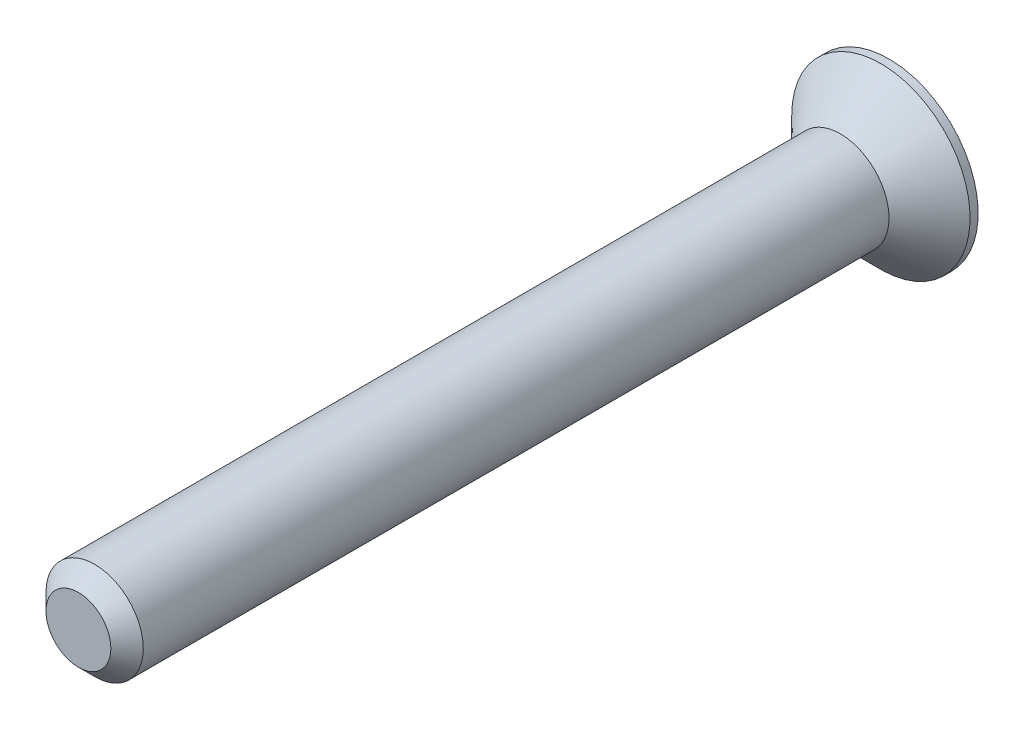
ISO-10303-21;
HEADER;
FILE_DESCRIPTION(('STEP AP214'),'2;1');
FILE_NAME('part.step','',(''),(''),'','','');
FILE_SCHEMA(('AUTOMOTIVE_DESIGN { 1 0 10303 214 1 1 1 1 }'));
ENDSEC;
DATA;
#1=APPLICATION_CONTEXT('core data for automotive mechanical design processes');
#2=APPLICATION_PROTOCOL_DEFINITION('international standard','automotive_design',2000,#1);
#3=PRODUCT_CONTEXT('',#1,'mechanical');
#4=PRODUCT('Part','Part','',(#3));
#5=PRODUCT_RELATED_PRODUCT_CATEGORY('part','',(#4));
#6=PRODUCT_DEFINITION_FORMATION('','',#4);
#7=PRODUCT_DEFINITION_CONTEXT('part definition',#1,'design');
#8=PRODUCT_DEFINITION('design','',#6,#7);
#9=PRODUCT_DEFINITION_SHAPE('','',#8);
#10=(LENGTH_UNIT() NAMED_UNIT(*) SI_UNIT(.MILLI.,.METRE.));
#11=(NAMED_UNIT(*) PLANE_ANGLE_UNIT() SI_UNIT($,.RADIAN.));
#12=(NAMED_UNIT(*) SI_UNIT($,.STERADIAN.) SOLID_ANGLE_UNIT());
#13=UNCERTAINTY_MEASURE_WITH_UNIT(LENGTH_MEASURE(1.E-05),#10,'distance_accuracy_value','');
#14=(GEOMETRIC_REPRESENTATION_CONTEXT(3) GLOBAL_UNCERTAINTY_ASSIGNED_CONTEXT((#13)) GLOBAL_UNIT_ASSIGNED_CONTEXT((#10,
#11,#12)) REPRESENTATION_CONTEXT('',''));
#15=CARTESIAN_POINT('',(0.,0.,0.));
#16=DIRECTION('',(0.,0.,1.));
#17=DIRECTION('',(1.,0.,0.));
#18=AXIS2_PLACEMENT_3D('',#15,#16,#17);
#19=CARTESIAN_POINT('',(-40.,30.,47.));
#20=DIRECTION('',(0.,0.,-1.));
#21=DIRECTION('',(-1.,0.,0.));
#22=AXIS2_PLACEMENT_3D('',#19,#20,#21);
#23=CYLINDRICAL_SURFACE('',#22,3.);
#24=CARTESIAN_POINT('',(-40.,30.,46.));
#25=DIRECTION('',(0.,0.,1.));
#26=DIRECTION('',(1.,0.,0.));
#27=AXIS2_PLACEMENT_3D('',#24,#25,#26);
#28=CIRCLE('',#27,3.);
#29=CARTESIAN_POINT('',(-37.,30.,46.));
#30=VERTEX_POINT('',#29);
#31=EDGE_CURVE('E44',#30,#30,#28,.F.);
#32=ORIENTED_EDGE('',*,*,#31,.T.);
#33=EDGE_LOOP('',(#32));
#34=FACE_BOUND('',#33,.T.);
#35=CARTESIAN_POINT('',(-40.,30.,0.));
#36=DIRECTION('',(0.,0.,-1.));
#37=DIRECTION('',(-1.,0.,0.));
#38=AXIS2_PLACEMENT_3D('',#35,#36,#37);
#39=CIRCLE('',#38,3.);
#40=CARTESIAN_POINT('',(-43.,30.,0.));
#41=VERTEX_POINT('',#40);
#42=EDGE_CURVE('E212',#41,#41,#39,.T.);
#43=ORIENTED_EDGE('',*,*,#42,.F.);
#44=EDGE_LOOP('',(#43));
#45=FACE_BOUND('',#44,.T.);
#46=ADVANCED_FACE('F36',(#34,#45),#23,.T.);
#47=CARTESIAN_POINT('',(-40.,30.,47.));
#48=DIRECTION('',(0.,0.,1.));
#49=DIRECTION('',(1.,0.,0.));
#50=AXIS2_PLACEMENT_3D('',#47,#48,#49);
#51=PLANE('',#50);
#52=CARTESIAN_POINT('',(-40.,30.,47.));
#53=DIRECTION('',(0.,0.,1.));
#54=DIRECTION('',(1.,0.,0.));
#55=AXIS2_PLACEMENT_3D('',#52,#53,#54);
#56=CIRCLE('',#55,2.00000000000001);
#57=CARTESIAN_POINT('',(-38.,30.,47.));
#58=VERTEX_POINT('',#57);
#59=EDGE_CURVE('E215',#58,#58,#56,.T.);
#60=ORIENTED_EDGE('',*,*,#59,.T.);
#61=EDGE_LOOP('',(#60));
#62=FACE_BOUND('',#61,.T.);
#63=ADVANCED_FACE('F228',(#62),#51,.T.);
#64=CARTESIAN_POINT('',(-40.,30.,-3.));
#65=DIRECTION('',(0.,0.,1.));
#66=DIRECTION('',(1.,0.,0.));
#67=AXIS2_PLACEMENT_3D('',#64,#65,#66);
#68=CYLINDRICAL_SURFACE('',#67,5.5);
#69=CARTESIAN_POINT('',(-40.,30.,-2.49999999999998));
#70=DIRECTION('',(0.,0.,-1.));
#71=DIRECTION('',(-1.,0.,0.));
#72=AXIS2_PLACEMENT_3D('',#69,#70,#71);
#73=CIRCLE('',#72,5.5);
#74=CARTESIAN_POINT('',(-45.5,30.,-2.49999999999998));
#75=VERTEX_POINT('',#74);
#76=EDGE_CURVE('E11',#75,#75,#73,.T.);
#77=ORIENTED_EDGE('',*,*,#76,.T.);
#78=EDGE_LOOP('',(#77));
#79=FACE_BOUND('',#78,.T.);
#80=CARTESIAN_POINT('',(-40.,30.,-3.));
#81=DIRECTION('',(0.,0.,-1.));
#82=DIRECTION('',(-1.,0.,0.));
#83=AXIS2_PLACEMENT_3D('',#80,#81,#82);
#84=CIRCLE('',#83,5.5);
#85=CARTESIAN_POINT('',(-45.5,30.,-3.));
#86=VERTEX_POINT('',#85);
#87=EDGE_CURVE('E192',#86,#86,#84,.T.);
#88=ORIENTED_EDGE('',*,*,#87,.F.);
#89=EDGE_LOOP('',(#88));
#90=FACE_BOUND('',#89,.T.);
#91=ADVANCED_FACE('F230',(#79,#90),#68,.T.);
#92=CARTESIAN_POINT('',(-40.,30.,-3.));
#93=DIRECTION('',(0.,0.,-1.));
#94=DIRECTION('',(-1.,0.,0.));
#95=AXIS2_PLACEMENT_3D('',#92,#93,#94);
#96=PLANE('',#95);
#97=DIRECTION('',(0.,-1.,0.));
#98=VECTOR('',#97,1.);
#99=CARTESIAN_POINT('',(-39.,27.,-3.));
#100=LINE('',#99,#98);
#101=CARTESIAN_POINT('',(-39.,29.,-3.));
#102=VERTEX_POINT('',#101);
#103=CARTESIAN_POINT('',(-39.,27.,-3.));
#104=VERTEX_POINT('',#103);
#105=EDGE_CURVE('E51',#102,#104,#100,.T.);
#106=ORIENTED_EDGE('',*,*,#105,.F.);
#107=DIRECTION('',(-1.,0.,0.));
#108=VECTOR('',#107,1.);
#109=CARTESIAN_POINT('',(-37.,29.,-3.));
#110=LINE('',#109,#108);
#111=CARTESIAN_POINT('',(-37.,29.,-3.));
#112=VERTEX_POINT('',#111);
#113=EDGE_CURVE('E188',#112,#102,#110,.T.);
#114=ORIENTED_EDGE('',*,*,#113,.F.);
#115=DIRECTION('',(0.,-1.,0.));
#116=VECTOR('',#115,1.);
#117=CARTESIAN_POINT('',(-37.,31.,-3.));
#118=LINE('',#117,#116);
#119=CARTESIAN_POINT('',(-37.,31.,-3.));
#120=VERTEX_POINT('',#119);
#121=EDGE_CURVE('E186',#120,#112,#118,.T.);
#122=ORIENTED_EDGE('',*,*,#121,.F.);
#123=DIRECTION('',(1.,0.,0.));
#124=VECTOR('',#123,1.);
#125=CARTESIAN_POINT('',(-37.,31.,-3.));
#126=LINE('',#125,#124);
#127=CARTESIAN_POINT('',(-39.,31.,-3.));
#128=VERTEX_POINT('',#127);
#129=EDGE_CURVE('E135',#128,#120,#126,.T.);
#130=ORIENTED_EDGE('',*,*,#129,.F.);
#131=DIRECTION('',(0.,-1.,0.));
#132=VECTOR('',#131,1.);
#133=CARTESIAN_POINT('',(-39.,31.,-3.));
#134=LINE('',#133,#132);
#135=CARTESIAN_POINT('',(-39.,33.,-3.));
#136=VERTEX_POINT('',#135);
#137=EDGE_CURVE('E182',#136,#128,#134,.T.);
#138=ORIENTED_EDGE('',*,*,#137,.F.);
#139=DIRECTION('',(1.,0.,0.));
#140=VECTOR('',#139,1.);
#141=CARTESIAN_POINT('',(-39.,33.,-3.));
#142=LINE('',#141,#140);
#143=CARTESIAN_POINT('',(-41.,33.,-3.));
#144=VERTEX_POINT('',#143);
#145=EDGE_CURVE('E179',#144,#136,#142,.T.);
#146=ORIENTED_EDGE('',*,*,#145,.F.);
#147=DIRECTION('',(0.,1.,0.));
#148=VECTOR('',#147,1.);
#149=CARTESIAN_POINT('',(-41.,31.,-3.));
#150=LINE('',#149,#148);
#151=CARTESIAN_POINT('',(-41.,31.,-3.));
#152=VERTEX_POINT('',#151);
#153=EDGE_CURVE('E176',#152,#144,#150,.T.);
#154=ORIENTED_EDGE('',*,*,#153,.F.);
#155=DIRECTION('',(1.,0.,0.));
#156=VECTOR('',#155,1.);
#157=CARTESIAN_POINT('',(-41.,31.,-3.));
#158=LINE('',#157,#156);
#159=CARTESIAN_POINT('',(-43.,31.,-3.));
#160=VERTEX_POINT('',#159);
#161=EDGE_CURVE('E173',#160,#152,#158,.T.);
#162=ORIENTED_EDGE('',*,*,#161,.F.);
#163=DIRECTION('',(0.,1.,0.));
#164=VECTOR('',#163,1.);
#165=CARTESIAN_POINT('',(-43.,31.,-3.));
#166=LINE('',#165,#164);
#167=CARTESIAN_POINT('',(-43.,29.,-3.));
#168=VERTEX_POINT('',#167);
#169=EDGE_CURVE('E170',#168,#160,#166,.T.);
#170=ORIENTED_EDGE('',*,*,#169,.F.);
#171=DIRECTION('',(-1.,0.,0.));
#172=VECTOR('',#171,1.);
#173=CARTESIAN_POINT('',(-41.,29.,-3.));
#174=LINE('',#173,#172);
#175=CARTESIAN_POINT('',(-41.,29.,-3.));
#176=VERTEX_POINT('',#175);
#177=EDGE_CURVE('E167',#176,#168,#174,.T.);
#178=ORIENTED_EDGE('',*,*,#177,.F.);
#179=DIRECTION('',(0.,1.,0.));
#180=VECTOR('',#179,1.);
#181=CARTESIAN_POINT('',(-41.,27.,-3.));
#182=LINE('',#181,#180);
#183=CARTESIAN_POINT('',(-41.,27.,-3.));
#184=VERTEX_POINT('',#183);
#185=EDGE_CURVE('E164',#184,#176,#182,.T.);
#186=ORIENTED_EDGE('',*,*,#185,.F.);
#187=DIRECTION('',(-1.,0.,0.));
#188=VECTOR('',#187,1.);
#189=CARTESIAN_POINT('',(-39.,27.,-3.));
#190=LINE('',#189,#188);
#191=EDGE_CURVE('E161',#104,#184,#190,.T.);
#192=ORIENTED_EDGE('',*,*,#191,.F.);
#193=EDGE_LOOP('',(#106,#114,#122,#130,#138,#146,#154,#162,#170,#178,#186,#192));
#194=FACE_BOUND('',#193,.T.);
#195=ORIENTED_EDGE('',*,*,#87,.T.);
#196=EDGE_LOOP('',(#195));
#197=FACE_BOUND('',#196,.T.);
#198=ADVANCED_FACE('F225',(#194,#197),#96,.T.);
#199=CARTESIAN_POINT('',(-40.,30.,47.));
#200=DIRECTION('',(0.,0.,-1.));
#201=DIRECTION('',(-1.,0.,0.));
#202=AXIS2_PLACEMENT_3D('',#199,#200,#201);
#203=CONICAL_SURFACE('',#202,2.00000000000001,0.785398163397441);
#204=ORIENTED_EDGE('',*,*,#31,.F.);
#205=EDGE_LOOP('',(#204));
#206=FACE_BOUND('',#205,.T.);
#207=ORIENTED_EDGE('',*,*,#59,.F.);
#208=EDGE_LOOP('',(#207));
#209=FACE_BOUND('',#208,.T.);
#210=ADVANCED_FACE('F222',(#206,#209),#203,.T.);
#211=CARTESIAN_POINT('',(-40.,30.,-2.49999999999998));
#212=DIRECTION('',(0.,0.,-1.));
#213=DIRECTION('',(-1.,0.,0.));
#214=AXIS2_PLACEMENT_3D('',#211,#212,#213);
#215=CONICAL_SURFACE('',#214,5.5,0.785398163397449);
#216=ORIENTED_EDGE('',*,*,#42,.T.);
#217=EDGE_LOOP('',(#216));
#218=FACE_BOUND('',#217,.T.);
#219=ORIENTED_EDGE('',*,*,#76,.F.);
#220=EDGE_LOOP('',(#219));
#221=FACE_BOUND('',#220,.T.);
#222=ADVANCED_FACE('F38',(#218,#221),#215,.T.);
#223=CARTESIAN_POINT('',(-39.,27.,-0.5));
#224=DIRECTION('',(1.,0.,0.));
#225=DIRECTION('',(0.,0.,-1.));
#226=AXIS2_PLACEMENT_3D('',#223,#224,#225);
#227=PLANE('',#226);
#228=ORIENTED_EDGE('',*,*,#105,.T.);
#229=DIRECTION('',(0.,0.,-1.));
#230=VECTOR('',#229,1.);
#231=CARTESIAN_POINT('',(-39.,27.,-0.5));
#232=LINE('',#231,#230);
#233=CARTESIAN_POINT('',(-39.,27.,-0.5));
#234=VERTEX_POINT('',#233);
#235=EDGE_CURVE('E99',#234,#104,#232,.T.);
#236=ORIENTED_EDGE('',*,*,#235,.F.);
#237=DIRECTION('',(0.,-1.,0.));
#238=VECTOR('',#237,1.);
#239=CARTESIAN_POINT('',(-39.,27.,-0.5));
#240=LINE('',#239,#238);
#241=CARTESIAN_POINT('',(-39.,29.,-0.5));
#242=VERTEX_POINT('',#241);
#243=EDGE_CURVE('E190',#242,#234,#240,.T.);
#244=ORIENTED_EDGE('',*,*,#243,.F.);
#245=DIRECTION('',(0.,0.,-1.));
#246=VECTOR('',#245,1.);
#247=CARTESIAN_POINT('',(-39.,29.,-0.5));
#248=LINE('',#247,#246);
#249=EDGE_CURVE('E59',#242,#102,#248,.T.);
#250=ORIENTED_EDGE('',*,*,#249,.T.);
#251=EDGE_LOOP('',(#228,#236,#244,#250));
#252=FACE_BOUND('',#251,.T.);
#253=ADVANCED_FACE('F243',(#252),#227,.F.);
#254=CARTESIAN_POINT('',(-37.,29.,-0.5));
#255=DIRECTION('',(0.,-1.,0.));
#256=DIRECTION('',(0.,0.,-1.));
#257=AXIS2_PLACEMENT_3D('',#254,#255,#256);
#258=PLANE('',#257);
#259=ORIENTED_EDGE('',*,*,#113,.T.);
#260=ORIENTED_EDGE('',*,*,#249,.F.);
#261=DIRECTION('',(-1.,0.,0.));
#262=VECTOR('',#261,1.);
#263=CARTESIAN_POINT('',(-37.,29.,-0.5));
#264=LINE('',#263,#262);
#265=CARTESIAN_POINT('',(-37.,29.,-0.5));
#266=VERTEX_POINT('',#265);
#267=EDGE_CURVE('E147',#266,#242,#264,.T.);
#268=ORIENTED_EDGE('',*,*,#267,.F.);
#269=DIRECTION('',(0.,0.,-1.));
#270=VECTOR('',#269,1.);
#271=CARTESIAN_POINT('',(-37.,29.,-0.5));
#272=LINE('',#271,#270);
#273=EDGE_CURVE('E139',#266,#112,#272,.T.);
#274=ORIENTED_EDGE('',*,*,#273,.T.);
#275=EDGE_LOOP('',(#259,#260,#268,#274));
#276=FACE_BOUND('',#275,.T.);
#277=ADVANCED_FACE('F246',(#276),#258,.F.);
#278=CARTESIAN_POINT('',(-37.,31.,-0.5));
#279=DIRECTION('',(1.,0.,0.));
#280=DIRECTION('',(0.,0.,-1.));
#281=AXIS2_PLACEMENT_3D('',#278,#279,#280);
#282=PLANE('',#281);
#283=ORIENTED_EDGE('',*,*,#121,.T.);
#284=ORIENTED_EDGE('',*,*,#273,.F.);
#285=DIRECTION('',(0.,-1.,0.));
#286=VECTOR('',#285,1.);
#287=CARTESIAN_POINT('',(-37.,31.,-0.5));
#288=LINE('',#287,#286);
#289=CARTESIAN_POINT('',(-37.,31.,-0.5));
#290=VERTEX_POINT('',#289);
#291=EDGE_CURVE('E143',#290,#266,#288,.T.);
#292=ORIENTED_EDGE('',*,*,#291,.F.);
#293=DIRECTION('',(0.,0.,-1.));
#294=VECTOR('',#293,1.);
#295=CARTESIAN_POINT('',(-37.,31.,-0.5));
#296=LINE('',#295,#294);
#297=EDGE_CURVE('E128',#290,#120,#296,.T.);
#298=ORIENTED_EDGE('',*,*,#297,.T.);
#299=EDGE_LOOP('',(#283,#284,#292,#298));
#300=FACE_BOUND('',#299,.T.);
#301=ADVANCED_FACE('F144',(#300),#282,.F.);
#302=CARTESIAN_POINT('',(-37.,31.,-0.5));
#303=DIRECTION('',(0.,1.,0.));
#304=DIRECTION('',(0.,0.,1.));
#305=AXIS2_PLACEMENT_3D('',#302,#303,#304);
#306=PLANE('',#305);
#307=ORIENTED_EDGE('',*,*,#129,.T.);
#308=ORIENTED_EDGE('',*,*,#297,.F.);
#309=DIRECTION('',(1.,0.,0.));
#310=VECTOR('',#309,1.);
#311=CARTESIAN_POINT('',(-37.,31.,-0.5));
#312=LINE('',#311,#310);
#313=CARTESIAN_POINT('',(-39.,31.,-0.5));
#314=VERTEX_POINT('',#313);
#315=EDGE_CURVE('E132',#314,#290,#312,.T.);
#316=ORIENTED_EDGE('',*,*,#315,.F.);
#317=DIRECTION('',(0.,0.,-1.));
#318=VECTOR('',#317,1.);
#319=CARTESIAN_POINT('',(-39.,31.,-0.5));
#320=LINE('',#319,#318);
#321=EDGE_CURVE('E140',#314,#128,#320,.T.);
#322=ORIENTED_EDGE('',*,*,#321,.T.);
#323=EDGE_LOOP('',(#307,#308,#316,#322));
#324=FACE_BOUND('',#323,.T.);
#325=ADVANCED_FACE('F130',(#324),#306,.F.);
#326=CARTESIAN_POINT('',(-39.,31.,-0.5));
#327=DIRECTION('',(1.,0.,0.));
#328=DIRECTION('',(0.,0.,-1.));
#329=AXIS2_PLACEMENT_3D('',#326,#327,#328);
#330=PLANE('',#329);
#331=ORIENTED_EDGE('',*,*,#137,.T.);
#332=ORIENTED_EDGE('',*,*,#321,.F.);
#333=DIRECTION('',(0.,-1.,0.));
#334=VECTOR('',#333,1.);
#335=CARTESIAN_POINT('',(-39.,31.,-0.5));
#336=LINE('',#335,#334);
#337=CARTESIAN_POINT('',(-39.,33.,-0.5));
#338=VERTEX_POINT('',#337);
#339=EDGE_CURVE('E153',#338,#314,#336,.T.);
#340=ORIENTED_EDGE('',*,*,#339,.F.);
#341=DIRECTION('',(0.,0.,-1.));
#342=VECTOR('',#341,1.);
#343=CARTESIAN_POINT('',(-39.,33.,-0.5));
#344=LINE('',#343,#342);
#345=EDGE_CURVE('E195',#338,#136,#344,.T.);
#346=ORIENTED_EDGE('',*,*,#345,.T.);
#347=EDGE_LOOP('',(#331,#332,#340,#346));
#348=FACE_BOUND('',#347,.T.);
#349=ADVANCED_FACE('F274',(#348),#330,.F.);
#350=CARTESIAN_POINT('',(-39.,33.,-0.5));
#351=DIRECTION('',(0.,1.,0.));
#352=DIRECTION('',(0.,0.,1.));
#353=AXIS2_PLACEMENT_3D('',#350,#351,#352);
#354=PLANE('',#353);
#355=ORIENTED_EDGE('',*,*,#145,.T.);
#356=ORIENTED_EDGE('',*,*,#345,.F.);
#357=DIRECTION('',(1.,0.,0.));
#358=VECTOR('',#357,1.);
#359=CARTESIAN_POINT('',(-39.,33.,-0.5));
#360=LINE('',#359,#358);
#361=CARTESIAN_POINT('',(-41.,33.,-0.5));
#362=VERTEX_POINT('',#361);
#363=EDGE_CURVE('E155',#362,#338,#360,.T.);
#364=ORIENTED_EDGE('',*,*,#363,.F.);
#365=DIRECTION('',(0.,0.,-1.));
#366=VECTOR('',#365,1.);
#367=CARTESIAN_POINT('',(-41.,33.,-0.5));
#368=LINE('',#367,#366);
#369=EDGE_CURVE('E197',#362,#144,#368,.T.);
#370=ORIENTED_EDGE('',*,*,#369,.T.);
#371=EDGE_LOOP('',(#355,#356,#364,#370));
#372=FACE_BOUND('',#371,.T.);
#373=ADVANCED_FACE('F270',(#372),#354,.F.);
#374=CARTESIAN_POINT('',(-41.,31.,-0.5));
#375=DIRECTION('',(-1.,0.,0.));
#376=DIRECTION('',(0.,0.,1.));
#377=AXIS2_PLACEMENT_3D('',#374,#375,#376);
#378=PLANE('',#377);
#379=ORIENTED_EDGE('',*,*,#153,.T.);
#380=ORIENTED_EDGE('',*,*,#369,.F.);
#381=DIRECTION('',(0.,1.,0.));
#382=VECTOR('',#381,1.);
#383=CARTESIAN_POINT('',(-41.,31.,-0.5));
#384=LINE('',#383,#382);
#385=CARTESIAN_POINT('',(-41.,31.,-0.5));
#386=VERTEX_POINT('',#385);
#387=EDGE_CURVE('E434',#386,#362,#384,.T.);
#388=ORIENTED_EDGE('',*,*,#387,.F.);
#389=DIRECTION('',(0.,0.,-1.));
#390=VECTOR('',#389,1.);
#391=CARTESIAN_POINT('',(-41.,31.,-0.5));
#392=LINE('',#391,#390);
#393=EDGE_CURVE('E199',#386,#152,#392,.T.);
#394=ORIENTED_EDGE('',*,*,#393,.T.);
#395=EDGE_LOOP('',(#379,#380,#388,#394));
#396=FACE_BOUND('',#395,.T.);
#397=ADVANCED_FACE('F266',(#396),#378,.F.);
#398=CARTESIAN_POINT('',(-41.,31.,-0.5));
#399=DIRECTION('',(0.,1.,0.));
#400=DIRECTION('',(0.,0.,1.));
#401=AXIS2_PLACEMENT_3D('',#398,#399,#400);
#402=PLANE('',#401);
#403=ORIENTED_EDGE('',*,*,#161,.T.);
#404=ORIENTED_EDGE('',*,*,#393,.F.);
#405=DIRECTION('',(1.,0.,0.));
#406=VECTOR('',#405,1.);
#407=CARTESIAN_POINT('',(-41.,31.,-0.5));
#408=LINE('',#407,#406);
#409=CARTESIAN_POINT('',(-43.,31.,-0.5));
#410=VERTEX_POINT('',#409);
#411=EDGE_CURVE('E431',#410,#386,#408,.T.);
#412=ORIENTED_EDGE('',*,*,#411,.F.);
#413=DIRECTION('',(0.,0.,-1.));
#414=VECTOR('',#413,1.);
#415=CARTESIAN_POINT('',(-43.,31.,-0.5));
#416=LINE('',#415,#414);
#417=EDGE_CURVE('E201',#410,#160,#416,.T.);
#418=ORIENTED_EDGE('',*,*,#417,.T.);
#419=EDGE_LOOP('',(#403,#404,#412,#418));
#420=FACE_BOUND('',#419,.T.);
#421=ADVANCED_FACE('F262',(#420),#402,.F.);
#422=CARTESIAN_POINT('',(-43.,31.,-0.5));
#423=DIRECTION('',(-1.,0.,0.));
#424=DIRECTION('',(0.,0.,1.));
#425=AXIS2_PLACEMENT_3D('',#422,#423,#424);
#426=PLANE('',#425);
#427=ORIENTED_EDGE('',*,*,#169,.T.);
#428=ORIENTED_EDGE('',*,*,#417,.F.);
#429=DIRECTION('',(0.,1.,0.));
#430=VECTOR('',#429,1.);
#431=CARTESIAN_POINT('',(-43.,31.,-0.5));
#432=LINE('',#431,#430);
#433=CARTESIAN_POINT('',(-43.,29.,-0.5));
#434=VERTEX_POINT('',#433);
#435=EDGE_CURVE('E428',#434,#410,#432,.T.);
#436=ORIENTED_EDGE('',*,*,#435,.F.);
#437=DIRECTION('',(0.,0.,-1.));
#438=VECTOR('',#437,1.);
#439=CARTESIAN_POINT('',(-43.,29.,-0.5));
#440=LINE('',#439,#438);
#441=EDGE_CURVE('E203',#434,#168,#440,.T.);
#442=ORIENTED_EDGE('',*,*,#441,.T.);
#443=EDGE_LOOP('',(#427,#428,#436,#442));
#444=FACE_BOUND('',#443,.T.);
#445=ADVANCED_FACE('F258',(#444),#426,.F.);
#446=CARTESIAN_POINT('',(-41.,29.,-0.5));
#447=DIRECTION('',(0.,-1.,0.));
#448=DIRECTION('',(0.,0.,-1.));
#449=AXIS2_PLACEMENT_3D('',#446,#447,#448);
#450=PLANE('',#449);
#451=ORIENTED_EDGE('',*,*,#177,.T.);
#452=ORIENTED_EDGE('',*,*,#441,.F.);
#453=DIRECTION('',(-1.,0.,0.));
#454=VECTOR('',#453,1.);
#455=CARTESIAN_POINT('',(-41.,29.,-0.5));
#456=LINE('',#455,#454);
#457=CARTESIAN_POINT('',(-41.,29.,-0.5));
#458=VERTEX_POINT('',#457);
#459=EDGE_CURVE('E425',#458,#434,#456,.T.);
#460=ORIENTED_EDGE('',*,*,#459,.F.);
#461=DIRECTION('',(0.,0.,-1.));
#462=VECTOR('',#461,1.);
#463=CARTESIAN_POINT('',(-41.,29.,-0.5));
#464=LINE('',#463,#462);
#465=EDGE_CURVE('E205',#458,#176,#464,.T.);
#466=ORIENTED_EDGE('',*,*,#465,.T.);
#467=EDGE_LOOP('',(#451,#452,#460,#466));
#468=FACE_BOUND('',#467,.T.);
#469=ADVANCED_FACE('F254',(#468),#450,.F.);
#470=CARTESIAN_POINT('',(-41.,27.,-0.5));
#471=DIRECTION('',(-1.,0.,0.));
#472=DIRECTION('',(0.,0.,1.));
#473=AXIS2_PLACEMENT_3D('',#470,#471,#472);
#474=PLANE('',#473);
#475=ORIENTED_EDGE('',*,*,#185,.T.);
#476=ORIENTED_EDGE('',*,*,#465,.F.);
#477=DIRECTION('',(0.,1.,0.));
#478=VECTOR('',#477,1.);
#479=CARTESIAN_POINT('',(-41.,27.,-0.5));
#480=LINE('',#479,#478);
#481=CARTESIAN_POINT('',(-41.,27.,-0.5));
#482=VERTEX_POINT('',#481);
#483=EDGE_CURVE('E420',#482,#458,#480,.T.);
#484=ORIENTED_EDGE('',*,*,#483,.F.);
#485=DIRECTION('',(0.,0.,-1.));
#486=VECTOR('',#485,1.);
#487=CARTESIAN_POINT('',(-41.,27.,-0.5));
#488=LINE('',#487,#486);
#489=EDGE_CURVE('E207',#482,#184,#488,.T.);
#490=ORIENTED_EDGE('',*,*,#489,.T.);
#491=EDGE_LOOP('',(#475,#476,#484,#490));
#492=FACE_BOUND('',#491,.T.);
#493=ADVANCED_FACE('F250',(#492),#474,.F.);
#494=CARTESIAN_POINT('',(-39.,27.,-0.5));
#495=DIRECTION('',(0.,-1.,0.));
#496=DIRECTION('',(0.,0.,-1.));
#497=AXIS2_PLACEMENT_3D('',#494,#495,#496);
#498=PLANE('',#497);
#499=ORIENTED_EDGE('',*,*,#191,.T.);
#500=ORIENTED_EDGE('',*,*,#489,.F.);
#501=DIRECTION('',(-1.,0.,0.));
#502=VECTOR('',#501,1.);
#503=CARTESIAN_POINT('',(-39.,27.,-0.5));
#504=LINE('',#503,#502);
#505=EDGE_CURVE('E418',#234,#482,#504,.T.);
#506=ORIENTED_EDGE('',*,*,#505,.F.);
#507=ORIENTED_EDGE('',*,*,#235,.T.);
#508=EDGE_LOOP('',(#499,#500,#506,#507));
#509=FACE_BOUND('',#508,.T.);
#510=ADVANCED_FACE('F247',(#509),#498,.F.);
#511=CARTESIAN_POINT('',(-39.,29.,-0.5));
#512=DIRECTION('',(0.,0.,1.));
#513=DIRECTION('',(1.,0.,0.));
#514=AXIS2_PLACEMENT_3D('',#511,#512,#513);
#515=PLANE('',#514);
#516=ORIENTED_EDGE('',*,*,#243,.T.);
#517=ORIENTED_EDGE('',*,*,#505,.T.);
#518=ORIENTED_EDGE('',*,*,#483,.T.);
#519=ORIENTED_EDGE('',*,*,#459,.T.);
#520=ORIENTED_EDGE('',*,*,#435,.T.);
#521=ORIENTED_EDGE('',*,*,#411,.T.);
#522=ORIENTED_EDGE('',*,*,#387,.T.);
#523=ORIENTED_EDGE('',*,*,#363,.T.);
#524=ORIENTED_EDGE('',*,*,#339,.T.);
#525=ORIENTED_EDGE('',*,*,#315,.T.);
#526=ORIENTED_EDGE('',*,*,#291,.T.);
#527=ORIENTED_EDGE('',*,*,#267,.T.);
#528=EDGE_LOOP('',(#516,#517,#518,#519,#520,#521,#522,#523,#524,#525,#526,#527));
#529=FACE_BOUND('',#528,.T.);
#530=ADVANCED_FACE('F150',(#529),#515,.F.);
#531=CLOSED_SHELL('',(#46,#63,#91,#198,#210,#222,#253,#277,#301,#325,#349,#373,#397,#421,#445,
#469,#493,#510,#530));
#532=MANIFOLD_SOLID_BREP('B2',#531);
#533=ADVANCED_BREP_SHAPE_REPRESENTATION('',(#18,#532),#14);
#534=SHAPE_DEFINITION_REPRESENTATION(#9,#533);
ENDSEC;
END-ISO-10303-21;
